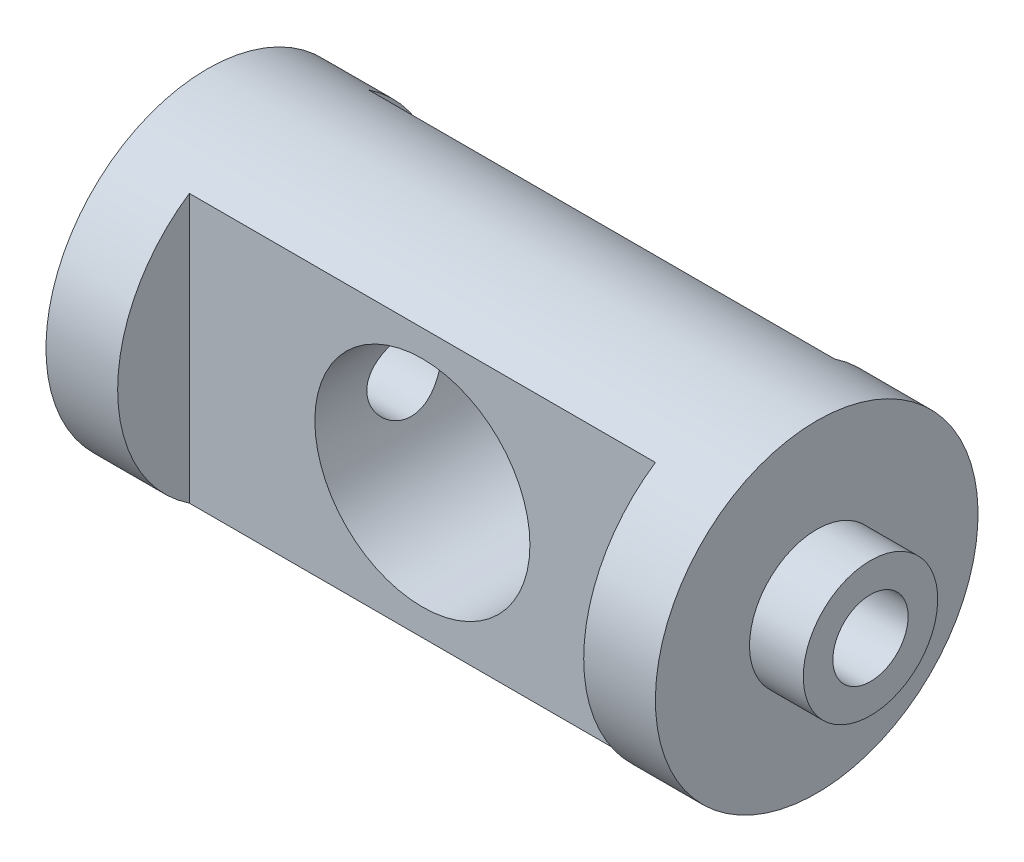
from build123d import *

# Parameters (mm, degrees)
SKETCH2_R         = 6
EXTRUDE1_DEPTH    = 10
M5_TAPPED_HOLE1_D = 4.2
SKETCH5_W         = 26
SKETCH5_H         = 4
EXTRUDE2_DEPTH    = 10


with BuildPart() as part:
    # Sketch1 → Revolve1 (revolve)
    with BuildSketch(Plane.XY):
        Polygon((0, 0), (0, 3.75), (3, 3.75), (3, 9), (37, 9), (37, 3.75), (40, 3.75), (40, 0), align=None)
    revolve(axis=Axis((40, 0, 0), (-1, 0, 0)))

    # Sketch2 → Extrude1 (cut, symmetric)
    with BuildSketch(Plane.XY):
        with Locations((20, 0)):
            Circle(SKETCH2_R)
    extrude(amount=EXTRUDE1_DEPTH, both=True, mode=Mode.SUBTRACT)

    # M5 Tapped Hole1 (through all)
    with Locations(Plane.YZ.offset(40)):
        with Locations((0, 0)):
            Hole(M5_TAPPED_HOLE1_D / 2)

    # Sketch5 → Extrude2 (cut, symmetric)
    with BuildSketch(Plane(origin=(0, 0, 0), x_dir=(1, 0, 0), z_dir=(0, 1, 0))):
        with Locations((20, -7)):
            Rectangle(SKETCH5_W, SKETCH5_H)
    extrude2 = extrude(amount=EXTRUDE2_DEPTH, both=True, mode=Mode.SUBTRACT)

    # Mirror1: Extrude2 across plane
    add(extrude2.mirror(Plane.XY), mode=Mode.SUBTRACT)


solid = part.part
